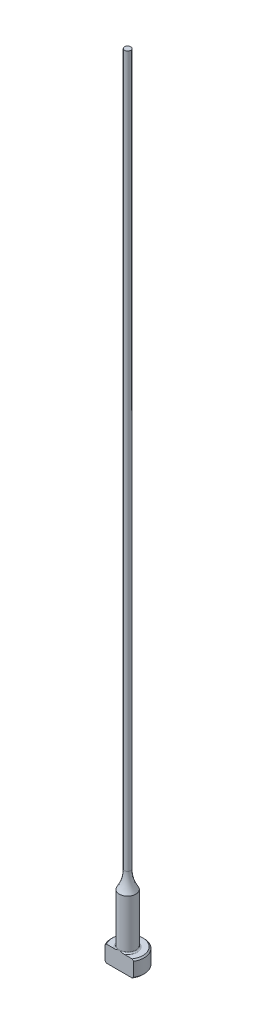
ISO-10303-21;
HEADER;
FILE_DESCRIPTION(('STEP AP214'),'2;1');
FILE_NAME('part.step','',(''),(''),'','','');
FILE_SCHEMA(('AUTOMOTIVE_DESIGN { 1 0 10303 214 1 1 1 1 }'));
ENDSEC;
DATA;
#1=APPLICATION_CONTEXT('core data for automotive mechanical design processes');
#2=APPLICATION_PROTOCOL_DEFINITION('international standard','automotive_design',2000,#1);
#3=PRODUCT_CONTEXT('',#1,'mechanical');
#4=PRODUCT('Part','Part','',(#3));
#5=PRODUCT_RELATED_PRODUCT_CATEGORY('part','',(#4));
#6=PRODUCT_DEFINITION_FORMATION('','',#4);
#7=PRODUCT_DEFINITION_CONTEXT('part definition',#1,'design');
#8=PRODUCT_DEFINITION('design','',#6,#7);
#9=PRODUCT_DEFINITION_SHAPE('','',#8);
#10=(LENGTH_UNIT() NAMED_UNIT(*) SI_UNIT(.MILLI.,.METRE.));
#11=(NAMED_UNIT(*) PLANE_ANGLE_UNIT() SI_UNIT($,.RADIAN.));
#12=(NAMED_UNIT(*) SI_UNIT($,.STERADIAN.) SOLID_ANGLE_UNIT());
#13=UNCERTAINTY_MEASURE_WITH_UNIT(LENGTH_MEASURE(1.E-05),#10,'distance_accuracy_value','');
#14=(GEOMETRIC_REPRESENTATION_CONTEXT(3) GLOBAL_UNCERTAINTY_ASSIGNED_CONTEXT((#13)) GLOBAL_UNIT_ASSIGNED_CONTEXT((#10,
#11,#12)) REPRESENTATION_CONTEXT('',''));
#15=CARTESIAN_POINT('',(0.,0.,0.));
#16=DIRECTION('',(0.,0.,1.));
#17=DIRECTION('',(1.,0.,0.));
#18=AXIS2_PLACEMENT_3D('',#15,#16,#17);
#19=CARTESIAN_POINT('',(-0.594359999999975,152.4,0.));
#20=DIRECTION('',(0.,1.,0.));
#21=DIRECTION('',(0.,0.,1.));
#22=AXIS2_PLACEMENT_3D('',#19,#20,#21);
#23=PLANE('',#22);
#24=CARTESIAN_POINT('',(0.,152.4,0.));
#25=DIRECTION('',(0.,1.,0.));
#26=DIRECTION('',(0.,0.,1.));
#27=AXIS2_PLACEMENT_3D('',#24,#25,#26);
#28=CIRCLE('',#27,0.594359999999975);
#29=CARTESIAN_POINT('',(0.,152.4,0.594359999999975));
#30=VERTEX_POINT('',#29);
#31=EDGE_CURVE('E164',#30,#30,#28,.T.);
#32=ORIENTED_EDGE('',*,*,#31,.T.);
#33=EDGE_LOOP('',(#32));
#34=FACE_BOUND('',#33,.T.);
#35=ADVANCED_FACE('F32',(#34),#23,.T.);
#36=CARTESIAN_POINT('',(0.,259.958771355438,0.));
#37=DIRECTION('',(0.,1.,0.));
#38=DIRECTION('',(0.,0.,1.));
#39=AXIS2_PLACEMENT_3D('',#36,#37,#38);
#40=CYLINDRICAL_SURFACE('',#39,0.594359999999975);
#41=CARTESIAN_POINT('',(0.,16.1097728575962,0.));
#42=DIRECTION('',(0.,1.,0.));
#43=DIRECTION('',(0.,0.,1.));
#44=AXIS2_PLACEMENT_3D('',#41,#42,#43);
#45=CIRCLE('',#44,0.594359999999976);
#46=CARTESIAN_POINT('',(0.,16.1097728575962,0.594359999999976));
#47=VERTEX_POINT('',#46);
#48=EDGE_CURVE('E167',#47,#47,#45,.T.);
#49=ORIENTED_EDGE('',*,*,#48,.T.);
#50=EDGE_LOOP('',(#49));
#51=FACE_BOUND('',#50,.T.);
#52=ORIENTED_EDGE('',*,*,#31,.F.);
#53=EDGE_LOOP('',(#52));
#54=FACE_BOUND('',#53,.T.);
#55=ADVANCED_FACE('F155',(#51,#54),#40,.T.);
#56=CARTESIAN_POINT('',(0.,16.1097728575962,0.));
#57=DIRECTION('',(0.,1.,0.));
#58=DIRECTION('',(0.,0.,1.));
#59=AXIS2_PLACEMENT_3D('',#56,#57,#58);
#60=TOROIDAL_SURFACE('',#59,6.94435999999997,6.35);
#61=CARTESIAN_POINT('',(0.,12.7,0.));
#62=DIRECTION('',(0.,1.,0.));
#63=DIRECTION('',(0.,0.,1.));
#64=AXIS2_PLACEMENT_3D('',#61,#62,#63);
#65=CIRCLE('',#64,1.58749999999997);
#66=CARTESIAN_POINT('',(0.,12.7,1.58749999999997));
#67=VERTEX_POINT('',#66);
#68=EDGE_CURVE('E95',#67,#67,#65,.T.);
#69=ORIENTED_EDGE('',*,*,#68,.T.);
#70=EDGE_LOOP('',(#69));
#71=FACE_BOUND('',#70,.T.);
#72=ORIENTED_EDGE('',*,*,#48,.F.);
#73=EDGE_LOOP('',(#72));
#74=FACE_BOUND('',#73,.T.);
#75=ADVANCED_FACE('F160',(#71,#74),#60,.F.);
#76=CARTESIAN_POINT('',(0.,259.958771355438,0.));
#77=DIRECTION('',(0.,1.,0.));
#78=DIRECTION('',(0.,0.,1.));
#79=AXIS2_PLACEMENT_3D('',#76,#77,#78);
#80=CYLINDRICAL_SURFACE('',#79,1.58749999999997);
#81=CARTESIAN_POINT('',(0.,3.42900000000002,0.));
#82=DIRECTION('',(0.,1.,0.));
#83=DIRECTION('',(0.,0.,1.));
#84=AXIS2_PLACEMENT_3D('',#81,#82,#83);
#85=CIRCLE('',#84,1.58749999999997);
#86=CARTESIAN_POINT('',(0.,3.42900000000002,1.58749999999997));
#87=VERTEX_POINT('',#86);
#88=EDGE_CURVE('E104',#87,#87,#85,.T.);
#89=ORIENTED_EDGE('',*,*,#88,.T.);
#90=EDGE_LOOP('',(#89));
#91=FACE_BOUND('',#90,.T.);
#92=ORIENTED_EDGE('',*,*,#68,.F.);
#93=EDGE_LOOP('',(#92));
#94=FACE_BOUND('',#93,.T.);
#95=ADVANCED_FACE('F187',(#91,#94),#80,.T.);
#96=CARTESIAN_POINT('',(-3.17499999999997,3.175,0.));
#97=DIRECTION('',(0.,1.,0.));
#98=DIRECTION('',(0.,0.,1.));
#99=AXIS2_PLACEMENT_3D('',#96,#97,#98);
#100=PLANE('',#99);
#101=DIRECTION('',(-1.,0.,0.));
#102=VECTOR('',#101,1.);
#103=CARTESIAN_POINT('',(-3.17499999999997,3.175,1.58749999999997));
#104=LINE('',#103,#102);
#105=CARTESIAN_POINT('',(2.45195529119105,3.175,1.58749999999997));
#106=VERTEX_POINT('',#105);
#107=CARTESIAN_POINT('',(0.933255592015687,3.175,1.58749999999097));
#108=VERTEX_POINT('',#107);
#109=EDGE_CURVE('E53',#106,#108,#104,.T.);
#110=ORIENTED_EDGE('',*,*,#109,.F.);
#111=CARTESIAN_POINT('',(0.,3.175,0.));
#112=DIRECTION('',(0.,1.,0.));
#113=DIRECTION('',(0.,0.,1.));
#114=AXIS2_PLACEMENT_3D('',#111,#112,#113);
#115=CIRCLE('',#114,2.92099999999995);
#116=CARTESIAN_POINT('',(-2.45195529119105,3.175,1.58749999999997));
#117=VERTEX_POINT('',#116);
#118=EDGE_CURVE('E166',#106,#117,#115,.T.);
#119=ORIENTED_EDGE('',*,*,#118,.T.);
#120=CARTESIAN_POINT('',(-0.933255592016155,3.17500000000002,1.58749999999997));
#121=VERTEX_POINT('',#120);
#122=EDGE_CURVE('E135',#121,#117,#104,.T.);
#123=ORIENTED_EDGE('',*,*,#122,.F.);
#124=CARTESIAN_POINT('',(0.,3.175,0.));
#125=DIRECTION('',(0.,1.,0.));
#126=DIRECTION('',(0.,0.,1.));
#127=AXIS2_PLACEMENT_3D('',#124,#125,#126);
#128=CIRCLE('',#127,1.84149999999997);
#129=EDGE_CURVE('E108',#121,#108,#128,.F.);
#130=ORIENTED_EDGE('',*,*,#129,.T.);
#131=EDGE_LOOP('',(#110,#119,#123,#130));
#132=FACE_BOUND('',#131,.T.);
#133=ADVANCED_FACE('F184',(#132),#100,.T.);
#134=CARTESIAN_POINT('',(0.,259.958771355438,0.));
#135=DIRECTION('',(0.,1.,0.));
#136=DIRECTION('',(0.,0.,1.));
#137=AXIS2_PLACEMENT_3D('',#134,#135,#136);
#138=CYLINDRICAL_SURFACE('',#137,3.17499999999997);
#139=DIRECTION('',(0.,-1.,0.));
#140=VECTOR('',#139,1.);
#141=CARTESIAN_POINT('',(-2.74963065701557,152.4,1.58749999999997));
#142=LINE('',#141,#140);
#143=CARTESIAN_POINT('',(-2.74963065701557,2.921,1.58749999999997));
#144=VERTEX_POINT('',#143);
#145=CARTESIAN_POINT('',(-2.74963065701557,0.254000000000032,1.58749999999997));
#146=VERTEX_POINT('',#145);
#147=EDGE_CURVE('E90',#144,#146,#142,.T.);
#148=ORIENTED_EDGE('',*,*,#147,.F.);
#149=CARTESIAN_POINT('',(0.,2.92100000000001,0.));
#150=DIRECTION('',(0.,1.,0.));
#151=DIRECTION('',(0.,0.,1.));
#152=AXIS2_PLACEMENT_3D('',#149,#150,#151);
#153=CIRCLE('',#152,3.17499999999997);
#154=CARTESIAN_POINT('',(2.74963065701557,2.921,1.58749999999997));
#155=VERTEX_POINT('',#154);
#156=EDGE_CURVE('E105',#144,#155,#153,.F.);
#157=ORIENTED_EDGE('',*,*,#156,.T.);
#158=DIRECTION('',(0.,-1.,0.));
#159=VECTOR('',#158,1.);
#160=CARTESIAN_POINT('',(2.74963065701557,152.4,1.58749999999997));
#161=LINE('',#160,#159);
#162=CARTESIAN_POINT('',(2.74963065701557,0.254000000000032,1.58749999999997));
#163=VERTEX_POINT('',#162);
#164=EDGE_CURVE('E177',#155,#163,#161,.T.);
#165=ORIENTED_EDGE('',*,*,#164,.T.);
#166=CARTESIAN_POINT('',(0.,0.254000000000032,0.));
#167=DIRECTION('',(0.,-1.,0.));
#168=DIRECTION('',(0.,0.,-1.));
#169=AXIS2_PLACEMENT_3D('',#166,#167,#168);
#170=CIRCLE('',#169,3.17499999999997);
#171=EDGE_CURVE('E111',#163,#146,#170,.F.);
#172=ORIENTED_EDGE('',*,*,#171,.T.);
#173=EDGE_LOOP('',(#148,#157,#165,#172));
#174=FACE_BOUND('',#173,.T.);
#175=ADVANCED_FACE('F175',(#174),#138,.T.);
#176=CARTESIAN_POINT('',(0.,0.,0.));
#177=DIRECTION('',(0.,-1.,0.));
#178=DIRECTION('',(0.,0.,-1.));
#179=AXIS2_PLACEMENT_3D('',#176,#177,#178);
#180=PLANE('',#179);
#181=DIRECTION('',(1.,0.,0.));
#182=VECTOR('',#181,1.);
#183=CARTESIAN_POINT('',(-2.74963065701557,0.,1.58749999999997));
#184=LINE('',#183,#182);
#185=CARTESIAN_POINT('',(-2.45195529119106,0.,1.58749999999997));
#186=VERTEX_POINT('',#185);
#187=CARTESIAN_POINT('',(2.45195529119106,0.,1.58749999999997));
#188=VERTEX_POINT('',#187);
#189=EDGE_CURVE('E87',#186,#188,#184,.T.);
#190=ORIENTED_EDGE('',*,*,#189,.F.);
#191=CARTESIAN_POINT('',(0.,0.,0.));
#192=DIRECTION('',(0.,-1.,0.));
#193=DIRECTION('',(0.,0.,-1.));
#194=AXIS2_PLACEMENT_3D('',#191,#192,#193);
#195=CIRCLE('',#194,2.92099999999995);
#196=EDGE_CURVE('E101',#186,#188,#195,.T.);
#197=ORIENTED_EDGE('',*,*,#196,.T.);
#198=EDGE_LOOP('',(#190,#197));
#199=FACE_BOUND('',#198,.T.);
#200=ADVANCED_FACE('F100',(#199),#180,.T.);
#201=CARTESIAN_POINT('',(0.,3.17499999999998,0.));
#202=DIRECTION('',(0.,-1.,0.));
#203=DIRECTION('',(0.,0.,-1.));
#204=AXIS2_PLACEMENT_3D('',#201,#202,#203);
#205=CONICAL_SURFACE('',#204,2.92099999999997,0.7853981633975);
#206=CARTESIAN_POINT('',(6.0529050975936,-0.161620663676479,1.58749999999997));
#207=CARTESIAN_POINT('',(5.91567682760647,-0.0288893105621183,1.58749999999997));
#208=CARTESIAN_POINT('',(5.77831035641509,0.103699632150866,1.58749999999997));
#209=CARTESIAN_POINT('',(5.5032187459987,0.368508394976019,1.58749999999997));
#210=CARTESIAN_POINT('',(5.36549360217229,0.500728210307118,1.58749999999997));
#211=CARTESIAN_POINT('',(5.08953516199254,0.764778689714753,1.58749999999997));
#212=CARTESIAN_POINT('',(4.95130164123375,0.896609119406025,1.58749999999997));
#213=CARTESIAN_POINT('',(4.67428233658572,1.15968706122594,1.58749999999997));
#214=CARTESIAN_POINT('',(4.53549655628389,1.29093457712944,1.58749999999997));
#215=CARTESIAN_POINT('',(4.2599772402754,1.55007705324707,1.58749999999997));
#216=CARTESIAN_POINT('',(4.12325766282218,1.67798684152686,1.58749999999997));
#217=CARTESIAN_POINT('',(3.84892898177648,1.93284861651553,1.58749999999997));
#218=CARTESIAN_POINT('',(3.71131988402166,2.05980060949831,1.58749999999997));
#219=CARTESIAN_POINT('',(3.43493978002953,2.31237508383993,1.58749999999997));
#220=CARTESIAN_POINT('',(3.29616903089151,2.43799784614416,1.58749999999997));
#221=CARTESIAN_POINT('',(3.01699558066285,2.68741369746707,1.58749999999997));
#222=CARTESIAN_POINT('',(2.87659294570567,2.81120686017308,1.58749999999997));
#223=CARTESIAN_POINT('',(2.6481670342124,3.0087586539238,1.58749999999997));
#224=CARTESIAN_POINT('',(2.56087478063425,3.08336151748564,1.58749999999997));
#225=CARTESIAN_POINT('',(2.38515423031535,3.23123871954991,1.58749999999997));
#226=CARTESIAN_POINT('',(2.29672582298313,3.30451292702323,1.58749999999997));
#227=CARTESIAN_POINT('',(2.1174740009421,3.45004422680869,1.58749999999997));
#228=CARTESIAN_POINT('',(2.02663514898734,3.52228237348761,1.58749999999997));
#229=CARTESIAN_POINT('',(1.8430252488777,3.66423097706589,1.58749999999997));
#230=CARTESIAN_POINT('',(1.75025467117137,3.73394203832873,1.58749999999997));
#231=CARTESIAN_POINT('',(1.56067475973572,3.87080633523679,1.58749999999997));
#232=CARTESIAN_POINT('',(1.4638254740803,3.93790459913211,1.58749999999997));
#233=CARTESIAN_POINT('',(1.266325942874,4.06669147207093,1.58749999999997));
#234=CARTESIAN_POINT('',(1.16567073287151,4.12837264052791,1.58749999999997));
#235=CARTESIAN_POINT('',(1.01165766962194,4.2140225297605,1.58749999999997));
#236=CARTESIAN_POINT('',(0.960142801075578,4.24127929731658,1.58749999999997));
#237=CARTESIAN_POINT('',(0.855780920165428,4.29309798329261,1.58749999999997));
#238=CARTESIAN_POINT('',(0.802933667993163,4.31765941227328,1.58749999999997));
#239=CARTESIAN_POINT('',(0.642461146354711,4.38614656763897,1.58749999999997));
#240=CARTESIAN_POINT('',(0.532518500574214,4.42510149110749,1.58749999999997));
#241=CARTESIAN_POINT('',(0.36768038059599,4.46726244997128,1.58749999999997));
#242=CARTESIAN_POINT('',(0.314802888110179,4.47844427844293,1.58749999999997));
#243=CARTESIAN_POINT('',(0.208209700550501,4.495766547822,1.58749999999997));
#244=CARTESIAN_POINT('',(0.154494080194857,4.50190743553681,1.58749999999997));
#245=CARTESIAN_POINT('',(0.0468792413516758,4.50871296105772,1.58749999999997));
#246=CARTESIAN_POINT('',(-0.00701889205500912,4.50939451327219,1.58749999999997));
#247=CARTESIAN_POINT('',(-0.114606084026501,4.50527679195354,1.58749999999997));
#248=CARTESIAN_POINT('',(-0.16829512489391,4.50047706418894,1.58749999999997));
#249=CARTESIAN_POINT('',(-0.274485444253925,4.48579689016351,1.58749999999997));
#250=CARTESIAN_POINT('',(-0.326992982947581,4.47596081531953,1.58749999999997));
#251=CARTESIAN_POINT('',(-0.430974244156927,4.45181809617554,1.58749999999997));
#252=CARTESIAN_POINT('',(-0.482447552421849,4.43750969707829,1.58749999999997));
#253=CARTESIAN_POINT('',(-0.584460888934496,4.40502489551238,1.58749999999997));
#254=CARTESIAN_POINT('',(-0.63499406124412,4.38682724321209,1.58749999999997));
#255=CARTESIAN_POINT('',(-0.734789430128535,4.34729308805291,1.58749999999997));
#256=CARTESIAN_POINT('',(-0.784051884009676,4.32595722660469,1.58749999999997));
#257=CARTESIAN_POINT('',(-0.930549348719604,4.25791922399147,1.58749999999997));
#258=CARTESIAN_POINT('',(-1.02598802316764,4.20736047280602,1.58749999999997));
#259=CARTESIAN_POINT('',(-1.21304313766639,4.09955451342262,1.58749999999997));
#260=CARTESIAN_POINT('',(-1.30465471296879,4.04229912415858,1.58749999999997));
#261=CARTESIAN_POINT('',(-1.48526211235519,3.9230874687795,1.58749999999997));
#262=CARTESIAN_POINT('',(-1.57424615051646,3.86111349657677,1.58749999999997));
#263=CARTESIAN_POINT('',(-1.74990003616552,3.73408621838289,1.58749999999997));
#264=CARTESIAN_POINT('',(-1.83657099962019,3.66903444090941,1.58749999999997));
#265=CARTESIAN_POINT('',(-2.00931764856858,3.53583371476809,1.58749999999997));
#266=CARTESIAN_POINT('',(-2.09537048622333,3.46765527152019,1.58749999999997));
#267=CARTESIAN_POINT('',(-2.26611736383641,3.32960643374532,1.58749999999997));
#268=CARTESIAN_POINT('',(-2.35081125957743,3.25973586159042,1.58749999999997));
#269=CARTESIAN_POINT('',(-2.60290121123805,3.04858139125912,1.58749999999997));
#270=CARTESIAN_POINT('',(-2.76872537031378,2.9054238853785,1.58749999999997));
#271=CARTESIAN_POINT('',(-3.06970913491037,2.64069522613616,1.58749999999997));
#272=CARTESIAN_POINT('',(-3.20528660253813,2.51959458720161,1.58749999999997));
#273=CARTESIAN_POINT('',(-3.47510321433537,2.275904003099,1.58749999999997));
#274=CARTESIAN_POINT('',(-3.60934232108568,2.15331401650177,1.58749999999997));
#275=CARTESIAN_POINT('',(-3.87695374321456,1.90694239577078,1.58749999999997));
#276=CARTESIAN_POINT('',(-4.01032512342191,1.78315974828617,1.58749999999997));
#277=CARTESIAN_POINT('',(-4.2763088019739,1.53478104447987,1.58749999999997));
#278=CARTESIAN_POINT('',(-4.40892109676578,1.41018498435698,1.58749999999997));
#279=CARTESIAN_POINT('',(-4.79499418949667,1.0457468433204,1.58749999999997));
#280=CARTESIAN_POINT('',(-5.04767313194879,0.805076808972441,1.58749999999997));
#281=CARTESIAN_POINT('',(-5.42550911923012,0.443121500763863,1.58749999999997));
#282=CARTESIAN_POINT('',(-5.55118772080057,0.322378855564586,1.58749999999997));
#283=CARTESIAN_POINT('',(-5.80225207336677,0.0805914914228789,1.58749999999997));
#284=CARTESIAN_POINT('',(-5.92763782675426,-0.0404532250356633,1.58749999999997));
#285=CARTESIAN_POINT('',(-6.0529050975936,-0.161620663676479,1.58749999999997));
#286=B_SPLINE_CURVE_WITH_KNOTS('',3,(#206,#207,#208,#209,#210,#211,#212,#213,#214,#215,#216,
#217,#218,#219,#220,#221,#222,#223,#224,#225,#226,#227,#228,#229,#230,#231,#232,#233,#234,#235,
#236,#237,#238,#239,#240,#241,#242,#243,#244,#245,#246,#247,#248,#249,#250,#251,#252,#253,#254,
#255,#256,#257,#258,#259,#260,#261,#262,#263,#264,#265,#266,#267,#268,#269,#270,#271,#272,#273,
#274,#275,#276,#277,#278,#279,#280,#281,#282,#283,#284,#285),.UNSPECIFIED.,.F.,.F.,(4,2,2,2,2,2,
2,2,2,2,2,2,2,2,2,2,2,2,2,2,2,2,2,2,2,2,2,2,2,2,2,2,2,2,2,2,2,2,2,4),(0.,0.572750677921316,
1.14550874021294,1.71856057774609,2.29160869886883,2.85328006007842,3.41494773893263,
3.97649423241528,4.53801804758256,4.88249307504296,5.22700189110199,5.57515326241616,
5.92322081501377,6.27657800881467,6.63041319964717,6.80518126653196,6.97998101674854,
7.32824262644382,7.49018491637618,7.65211285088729,7.813538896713,7.97497832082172,
8.13501929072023,8.29512313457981,8.4561251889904,8.61709438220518,8.94062993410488,
9.26456495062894,9.58978187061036,9.91483894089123,10.2441741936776,10.5735441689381,
11.2306812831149,11.7760337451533,12.3214014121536,12.8672825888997,13.4131663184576,
14.4600164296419,14.9828595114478,15.505698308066),.UNSPECIFIED.);
#287=EDGE_CURVE('E58',#155,#106,#286,.T.);
#288=ORIENTED_EDGE('',*,*,#287,.F.);
#289=ORIENTED_EDGE('',*,*,#156,.F.);
#290=EDGE_CURVE('E128',#117,#144,#286,.T.);
#291=ORIENTED_EDGE('',*,*,#290,.F.);
#292=ORIENTED_EDGE('',*,*,#118,.F.);
#293=EDGE_LOOP('',(#288,#289,#291,#292));
#294=FACE_BOUND('',#293,.T.);
#295=ADVANCED_FACE('F142',(#294),#205,.T.);
#296=CARTESIAN_POINT('',(0.,0.254000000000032,0.));
#297=DIRECTION('',(0.,1.,0.));
#298=DIRECTION('',(0.,0.,1.));
#299=AXIS2_PLACEMENT_3D('',#296,#297,#298);
#300=CONICAL_SURFACE('',#299,3.17499999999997,0.785398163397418);
#301=CARTESIAN_POINT('',(-6.0529050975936,3.33662066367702,1.58749999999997));
#302=CARTESIAN_POINT('',(-5.91567682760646,3.20388931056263,1.58749999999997));
#303=CARTESIAN_POINT('',(-5.77831035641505,3.0713003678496,1.58749999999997));
#304=CARTESIAN_POINT('',(-5.50321874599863,2.80649160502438,1.58749999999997));
#305=CARTESIAN_POINT('',(-5.36549360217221,2.67427178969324,1.58749999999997));
#306=CARTESIAN_POINT('',(-5.08953516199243,2.41022131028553,1.58749999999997));
#307=CARTESIAN_POINT('',(-4.95130164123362,2.27839088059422,1.58749999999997));
#308=CARTESIAN_POINT('',(-4.67428233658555,2.01531293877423,1.58749999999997));
#309=CARTESIAN_POINT('',(-4.5354965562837,1.8840654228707,1.58749999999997));
#310=CARTESIAN_POINT('',(-4.25997724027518,1.62492294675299,1.58749999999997));
#311=CARTESIAN_POINT('',(-4.12325766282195,1.49701315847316,1.58749999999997));
#312=CARTESIAN_POINT('',(-3.84892898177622,1.24215138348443,1.58749999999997));
#313=CARTESIAN_POINT('',(-3.71131988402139,1.11519939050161,1.58749999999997));
#314=CARTESIAN_POINT('',(-3.43493978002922,0.862624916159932,1.58749999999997));
#315=CARTESIAN_POINT('',(-3.29616903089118,0.737002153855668,1.58749999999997));
#316=CARTESIAN_POINT('',(-3.01699558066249,0.487586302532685,1.58749999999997));
#317=CARTESIAN_POINT('',(-2.8765929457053,0.363793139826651,1.58749999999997));
#318=CARTESIAN_POINT('',(-2.64816703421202,0.1662413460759,1.58749999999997));
#319=CARTESIAN_POINT('',(-2.56087478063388,0.0916384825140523,1.58749999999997));
#320=CARTESIAN_POINT('',(-2.385154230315,-0.0562387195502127,1.58749999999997));
#321=CARTESIAN_POINT('',(-2.29672582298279,-0.129512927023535,1.58749999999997));
#322=CARTESIAN_POINT('',(-2.11747400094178,-0.275044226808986,1.58749999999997));
#323=CARTESIAN_POINT('',(-2.02663514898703,-0.34728237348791,1.58749999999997));
#324=CARTESIAN_POINT('',(-1.84302524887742,-0.489230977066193,1.58749999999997));
#325=CARTESIAN_POINT('',(-1.75025467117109,-0.558942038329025,1.58749999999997));
#326=CARTESIAN_POINT('',(-1.56067475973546,-0.695806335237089,1.58749999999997));
#327=CARTESIAN_POINT('',(-1.46382547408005,-0.762904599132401,1.58749999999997));
#328=CARTESIAN_POINT('',(-1.26632594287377,-0.89169147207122,1.58749999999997));
#329=CARTESIAN_POINT('',(-1.16567073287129,-0.953372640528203,1.58749999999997));
#330=CARTESIAN_POINT('',(-1.01165766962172,-1.03902252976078,1.58749999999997));
#331=CARTESIAN_POINT('',(-0.960142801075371,-1.06627929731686,1.58749999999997));
#332=CARTESIAN_POINT('',(-0.855780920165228,-1.11809798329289,1.58749999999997));
#333=CARTESIAN_POINT('',(-0.802933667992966,-1.14265941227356,1.58749999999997));
#334=CARTESIAN_POINT('',(-0.642461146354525,-1.21114656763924,1.58749999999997));
#335=CARTESIAN_POINT('',(-0.532518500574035,-1.25010149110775,1.58749999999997));
#336=CARTESIAN_POINT('',(-0.367680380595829,-1.29226244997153,1.58749999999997));
#337=CARTESIAN_POINT('',(-0.314802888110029,-1.30344427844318,1.58749999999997));
#338=CARTESIAN_POINT('',(-0.208209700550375,-1.32076654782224,1.58749999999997));
#339=CARTESIAN_POINT('',(-0.154494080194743,-1.32690743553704,1.58749999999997));
#340=CARTESIAN_POINT('',(-0.0468792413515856,-1.33371296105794,1.58749999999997));
#341=CARTESIAN_POINT('',(0.00701889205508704,-1.33439451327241,1.58749999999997));
#342=CARTESIAN_POINT('',(0.114606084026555,-1.33027679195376,1.58749999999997));
#343=CARTESIAN_POINT('',(0.168295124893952,-1.32547706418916,1.58749999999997));
#344=CARTESIAN_POINT('',(0.274485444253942,-1.31079689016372,1.58749999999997));
#345=CARTESIAN_POINT('',(0.326992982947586,-1.30096081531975,1.58749999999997));
#346=CARTESIAN_POINT('',(0.430974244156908,-1.27681809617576,1.58749999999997));
#347=CARTESIAN_POINT('',(0.482447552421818,-1.26250969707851,1.58749999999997));
#348=CARTESIAN_POINT('',(0.58446088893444,-1.2300248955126,1.58749999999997));
#349=CARTESIAN_POINT('',(0.634994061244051,-1.21182724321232,1.58749999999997));
#350=CARTESIAN_POINT('',(0.734789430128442,-1.17229308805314,1.58749999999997));
#351=CARTESIAN_POINT('',(0.784051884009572,-1.15095722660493,1.58749999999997));
#352=CARTESIAN_POINT('',(0.930549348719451,-1.08291922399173,1.58749999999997));
#353=CARTESIAN_POINT('',(1.02598802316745,-1.0323604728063,1.58749999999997));
#354=CARTESIAN_POINT('',(1.21304313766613,-0.924554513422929,1.58749999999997));
#355=CARTESIAN_POINT('',(1.30465471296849,-0.867299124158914,1.58749999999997));
#356=CARTESIAN_POINT('',(1.48526211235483,-0.748087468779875,1.58749999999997));
#357=CARTESIAN_POINT('',(1.57424615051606,-0.686113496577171,1.58749999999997));
#358=CARTESIAN_POINT('',(1.74990003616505,-0.559086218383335,1.58749999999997));
#359=CARTESIAN_POINT('',(1.83657099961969,-0.494034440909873,1.58749999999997));
#360=CARTESIAN_POINT('',(2.00931764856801,-0.360833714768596,1.58749999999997));
#361=CARTESIAN_POINT('',(2.09537048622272,-0.292655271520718,1.58749999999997));
#362=CARTESIAN_POINT('',(2.26611736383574,-0.1546064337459,1.58749999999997));
#363=CARTESIAN_POINT('',(2.35081125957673,-0.0847358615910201,1.58749999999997));
#364=CARTESIAN_POINT('',(2.60290121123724,0.126418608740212,1.58749999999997));
#365=CARTESIAN_POINT('',(2.76872537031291,0.269576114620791,1.58749999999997));
#366=CARTESIAN_POINT('',(3.06970913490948,0.534304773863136,1.58749999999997));
#367=CARTESIAN_POINT('',(3.20528660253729,0.65540541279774,1.58749999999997));
#368=CARTESIAN_POINT('',(3.47510321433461,0.899095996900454,1.58749999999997));
#369=CARTESIAN_POINT('',(3.60934232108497,1.02168598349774,1.58749999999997));
#370=CARTESIAN_POINT('',(3.87695374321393,1.26805760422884,1.58749999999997));
#371=CARTESIAN_POINT('',(4.01032512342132,1.39184025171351,1.58749999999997));
#372=CARTESIAN_POINT('',(4.2763088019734,1.64021895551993,1.58749999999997));
#373=CARTESIAN_POINT('',(4.40892109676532,1.76481501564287,1.58749999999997));
#374=CARTESIAN_POINT('',(4.79499418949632,2.12925315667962,1.58749999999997));
#375=CARTESIAN_POINT('',(5.04767313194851,2.36992319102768,1.58749999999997));
#376=CARTESIAN_POINT('',(5.42550911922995,2.73187849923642,1.58749999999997));
#377=CARTESIAN_POINT('',(5.55118772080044,2.85262114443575,1.58749999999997));
#378=CARTESIAN_POINT('',(5.8022520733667,3.09440850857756,1.58749999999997));
#379=CARTESIAN_POINT('',(5.92763782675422,3.21545322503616,1.58749999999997));
#380=CARTESIAN_POINT('',(6.0529050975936,3.33662066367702,1.58749999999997));
#381=B_SPLINE_CURVE_WITH_KNOTS('',3,(#301,#302,#303,#304,#305,#306,#307,#308,#309,#310,#311,
#312,#313,#314,#315,#316,#317,#318,#319,#320,#321,#322,#323,#324,#325,#326,#327,#328,#329,#330,
#331,#332,#333,#334,#335,#336,#337,#338,#339,#340,#341,#342,#343,#344,#345,#346,#347,#348,#349,
#350,#351,#352,#353,#354,#355,#356,#357,#358,#359,#360,#361,#362,#363,#364,#365,#366,#367,#368,
#369,#370,#371,#372,#373,#374,#375,#376,#377,#378,#379,#380),.UNSPECIFIED.,.F.,.F.,(4,2,2,2,2,2,
2,2,2,2,2,2,2,2,2,2,2,2,2,2,2,2,2,2,2,2,2,2,2,2,2,2,2,2,2,2,2,2,2,4),(0.,0.57275067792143,
1.14550874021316,1.71856057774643,2.29160869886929,2.85328006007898,3.41494773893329,
3.97649423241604,4.53801804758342,4.8824930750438,5.22700189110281,5.57515326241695,
5.92322081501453,6.27657800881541,6.63041319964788,6.80518126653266,6.97998101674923,
7.32824262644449,7.49018491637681,7.65211285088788,7.81353889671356,7.97497832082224,
8.13501929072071,8.29512313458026,8.45612518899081,8.61709438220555,8.94062993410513,
9.26456495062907,9.58978187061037,9.91483894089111,10.2441741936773,10.5735441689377,
11.2306812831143,11.776033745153,12.3214014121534,12.8672825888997,13.4131663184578,
14.4600164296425,14.9828595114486,15.505698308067),.UNSPECIFIED.);
#382=EDGE_CURVE('E84',#146,#186,#381,.T.);
#383=ORIENTED_EDGE('',*,*,#382,.F.);
#384=ORIENTED_EDGE('',*,*,#171,.F.);
#385=EDGE_CURVE('E96',#188,#163,#381,.T.);
#386=ORIENTED_EDGE('',*,*,#385,.F.);
#387=ORIENTED_EDGE('',*,*,#196,.F.);
#388=EDGE_LOOP('',(#383,#384,#386,#387));
#389=FACE_BOUND('',#388,.T.);
#390=ADVANCED_FACE('F103',(#389),#300,.T.);
#391=CARTESIAN_POINT('',(0.,3.42900000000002,0.));
#392=DIRECTION('',(0.,1.,0.));
#393=DIRECTION('',(0.,0.,1.));
#394=AXIS2_PLACEMENT_3D('',#391,#392,#393);
#395=TOROIDAL_SURFACE('',#394,1.84149999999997,0.254);
#396=ORIENTED_EDGE('',*,*,#129,.F.);
#397=CARTESIAN_POINT('',(0.,3.42900000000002,1.58749999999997));
#398=CARTESIAN_POINT('',(-1.92205022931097E-10,3.42900057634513,1.58749999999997));
#399=CARTESIAN_POINT('',(-1.22611612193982E-07,3.42900115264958,1.58749999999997));
#400=CARTESIAN_POINT('',(-5.09676358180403E-07,3.42900226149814,1.58749999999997));
#401=CARTESIAN_POINT('',(-7.78176318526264E-07,3.42900279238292,1.58749999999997));
#402=CARTESIAN_POINT('',(-1.42307271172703E-06,3.42900385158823,1.58749999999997));
#403=CARTESIAN_POINT('',(-1.80713865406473E-06,3.4290043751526,1.58749999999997));
#404=CARTESIAN_POINT('',(-2.63494844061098E-06,3.42900536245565,1.58749999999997));
#405=CARTESIAN_POINT('',(-3.07814754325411E-06,3.42900582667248,1.58749999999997));
#406=CARTESIAN_POINT('',(-4.6689735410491E-06,3.4290073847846,1.58749999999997));
#407=CARTESIAN_POINT('',(-5.89404904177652E-06,3.42900840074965,1.58749999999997));
#408=CARTESIAN_POINT('',(-8.42427506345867E-06,3.42901020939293,1.58749999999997));
#409=CARTESIAN_POINT('',(-9.72480569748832E-06,3.42901100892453,1.58749999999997));
#410=CARTESIAN_POINT('',(-1.48060601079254E-05,3.42901401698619,1.58749999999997));
#411=CARTESIAN_POINT('',(-1.86838280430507E-05,3.42901606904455,1.58749999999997));
#412=CARTESIAN_POINT('',(-2.6326111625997E-05,3.42901942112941,1.58749999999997));
#413=CARTESIAN_POINT('',(-3.00687416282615E-05,3.42902077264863,1.58749999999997));
#414=CARTESIAN_POINT('',(-4.6027629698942E-05,3.4290265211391,1.58749999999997));
#415=CARTESIAN_POINT('',(-5.82470196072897E-05,3.42903088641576,1.58749999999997));
#416=CARTESIAN_POINT('',(-8.11070094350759E-05,3.42903788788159,1.58749999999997));
#417=CARTESIAN_POINT('',(-9.16953111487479E-05,3.42904068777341,1.58749999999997));
#418=CARTESIAN_POINT('',(-0.000168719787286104,3.42906287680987,1.58749999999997));
#419=CARTESIAN_POINT('',(-0.000232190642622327,3.42909118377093,1.58749999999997));
#420=CARTESIAN_POINT('',(-0.000479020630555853,3.42919723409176,1.58749999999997));
#421=CARTESIAN_POINT('',(-0.000664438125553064,3.42926834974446,1.58749999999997));
#422=CARTESIAN_POINT('',(-0.00138448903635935,3.4295486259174,1.58749999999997));
#423=CARTESIAN_POINT('',(-0.00191701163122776,3.42976473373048,1.58749999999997));
#424=CARTESIAN_POINT('',(-0.00409774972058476,3.43064550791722,1.58749999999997));
#425=CARTESIAN_POINT('',(-0.00574830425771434,3.43130231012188,1.58749999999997));
#426=CARTESIAN_POINT('',(-0.0289985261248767,3.44055947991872,1.58749999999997));
#427=CARTESIAN_POINT('',(-0.0505816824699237,3.44921674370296,1.58749999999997));
#428=CARTESIAN_POINT('',(-0.0929947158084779,3.46610702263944,1.58749999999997));
#429=CARTESIAN_POINT('',(-0.113823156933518,3.47434394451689,1.58749999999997));
#430=CARTESIAN_POINT('',(-0.157956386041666,3.49164606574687,1.58749999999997));
#431=CARTESIAN_POINT('',(-0.181267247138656,3.50069608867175,1.58749999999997));
#432=CARTESIAN_POINT('',(-0.228222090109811,3.51863224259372,1.58749999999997));
#433=CARTESIAN_POINT('',(-0.251867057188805,3.52751579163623,1.58749999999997));
#434=CARTESIAN_POINT('',(-0.310512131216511,3.54905503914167,1.58749999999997));
#435=CARTESIAN_POINT('',(-0.345588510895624,3.56150550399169,1.58749999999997));
#436=CARTESIAN_POINT('',(-0.415278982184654,3.58503024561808,1.58749999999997));
#437=CARTESIAN_POINT('',(-0.449884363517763,3.59613012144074,1.58749999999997));
#438=CARTESIAN_POINT('',(-0.52447121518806,3.61841679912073,1.58749999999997));
#439=CARTESIAN_POINT('',(-0.56451722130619,3.62939137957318,1.58749999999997));
#440=CARTESIAN_POINT('',(-0.645529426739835,3.6489746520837,1.58749999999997));
#441=CARTESIAN_POINT('',(-0.686500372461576,3.65756417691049,1.58749999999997));
#442=CARTESIAN_POINT('',(-0.771546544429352,3.67188287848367,1.58749999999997));
#443=CARTESIAN_POINT('',(-0.815658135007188,3.67740449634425,1.58749999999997));
#444=CARTESIAN_POINT('',(-0.904117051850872,3.68344603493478,1.58749999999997));
#445=CARTESIAN_POINT('',(-0.948462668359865,3.68398638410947,1.58749999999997));
#446=CARTESIAN_POINT('',(-1.02531896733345,3.67901051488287,1.58749999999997));
#447=CARTESIAN_POINT('',(-1.05792141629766,3.67502604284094,1.58749999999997));
#448=CARTESIAN_POINT('',(-1.12184393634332,3.6623083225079,1.58749999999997));
#449=CARTESIAN_POINT('',(-1.15317534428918,3.65363950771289,1.58749999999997));
#450=CARTESIAN_POINT('',(-1.19946468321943,3.63563847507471,1.58749999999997));
#451=CARTESIAN_POINT('',(-1.2152678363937,3.62848492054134,1.58749999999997));
#452=CARTESIAN_POINT('',(-1.24583726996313,3.61212937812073,1.58749999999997));
#453=CARTESIAN_POINT('',(-1.26060215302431,3.60292469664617,1.58749999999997));
#454=CARTESIAN_POINT('',(-1.28575815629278,3.58421518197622,1.58749999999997));
#455=CARTESIAN_POINT('',(-1.29644383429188,3.57510998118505,1.58749999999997));
#456=CARTESIAN_POINT('',(-1.31623154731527,3.55531539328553,1.58749999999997));
#457=CARTESIAN_POINT('',(-1.32533681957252,3.54462932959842,1.58749999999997));
#458=CARTESIAN_POINT('',(-1.33941140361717,3.52450022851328,1.58749999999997));
#459=CARTESIAN_POINT('',(-1.34484814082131,3.51538553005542,1.58749999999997));
#460=CARTESIAN_POINT('',(-1.35416329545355,3.49638544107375,1.58749999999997));
#461=CARTESIAN_POINT('',(-1.35804267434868,3.48650053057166,1.58749999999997));
#462=CARTESIAN_POINT('',(-1.36398436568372,3.46611321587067,1.58749999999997));
#463=CARTESIAN_POINT('',(-1.36603350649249,3.45560690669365,1.58749999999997));
#464=CARTESIAN_POINT('',(-1.3680840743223,3.43439627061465,1.58749999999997));
#465=CARTESIAN_POINT('',(-1.36808648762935,3.42369204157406,1.58749999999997));
#466=CARTESIAN_POINT('',(-1.36616208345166,3.40366716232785,1.58749999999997));
#467=CARTESIAN_POINT('',(-1.36444960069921,3.39432493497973,1.58749999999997));
#468=CARTESIAN_POINT('',(-1.35953338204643,3.37604480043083,1.58749999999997));
#469=CARTESIAN_POINT('',(-1.3563294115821,3.36710695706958,1.58749999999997));
#470=CARTESIAN_POINT('',(-1.34848006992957,3.34949697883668,1.58749999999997));
#471=CARTESIAN_POINT('',(-1.34378578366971,3.34084688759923,1.58749999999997));
#472=CARTESIAN_POINT('',(-1.33324445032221,3.32428742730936,1.58749999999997));
#473=CARTESIAN_POINT('',(-1.32739692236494,3.3163783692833,1.58749999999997));
#474=CARTESIAN_POINT('',(-1.3110730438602,3.29692878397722,1.58749999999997));
#475=CARTESIAN_POINT('',(-1.29989286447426,3.28597778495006,1.58749999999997));
#476=CARTESIAN_POINT('',(-1.27593566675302,3.26597490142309,1.58749999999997));
#477=CARTESIAN_POINT('',(-1.26315370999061,3.25692913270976,1.58749999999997));
#478=CARTESIAN_POINT('',(-1.2293073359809,3.23613976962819,1.58749999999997));
#479=CARTESIAN_POINT('',(-1.20751096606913,3.225594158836,1.58749999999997));
#480=CARTESIAN_POINT('',(-1.16266144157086,3.20795356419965,1.58749999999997));
#481=CARTESIAN_POINT('',(-1.13960937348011,3.20085564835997,1.58749999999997));
#482=CARTESIAN_POINT('',(-1.07603916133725,3.18534571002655,1.58749999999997));
#483=CARTESIAN_POINT('',(-1.03486686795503,3.17965078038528,1.58749999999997));
#484=CARTESIAN_POINT('',(-0.951558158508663,3.1741711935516,1.58749999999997));
#485=CARTESIAN_POINT('',(-0.909417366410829,3.17449023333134,1.58749999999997));
#486=CARTESIAN_POINT('',(-0.811383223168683,3.18054602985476,1.58749999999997));
#487=CARTESIAN_POINT('',(-0.755610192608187,3.18806126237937,1.58749999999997));
#488=CARTESIAN_POINT('',(-0.64493786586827,3.20866626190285,1.58749999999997));
#489=CARTESIAN_POINT('',(-0.59004364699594,3.22178102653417,1.58749999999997));
#490=CARTESIAN_POINT('',(-0.485757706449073,3.25059077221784,1.58749999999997));
#491=CARTESIAN_POINT('',(-0.436281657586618,3.26598903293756,1.58749999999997));
#492=CARTESIAN_POINT('',(-0.338551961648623,3.29877502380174,1.58749999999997));
#493=CARTESIAN_POINT('',(-0.290291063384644,3.31614156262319,1.58749999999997));
#494=CARTESIAN_POINT('',(-0.22555793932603,3.34039762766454,1.58749999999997));
#495=CARTESIAN_POINT('',(-0.208874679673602,3.34673586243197,1.58749999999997));
#496=CARTESIAN_POINT('',(-0.175123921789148,3.35969957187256,1.58749999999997));
#497=CARTESIAN_POINT('',(-0.158057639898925,3.36632823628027,1.58749999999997));
#498=CARTESIAN_POINT('',(-0.117638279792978,3.38214476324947,1.58749999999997));
#499=CARTESIAN_POINT('',(-0.0943002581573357,3.39137029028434,1.58749999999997));
#500=CARTESIAN_POINT('',(-0.0497824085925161,3.40910304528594,1.58749999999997));
#501=CARTESIAN_POINT('',(-0.0285986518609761,3.41759960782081,1.58749999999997));
#502=CARTESIAN_POINT('',(-0.00575168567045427,3.42669635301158,1.58749999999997));
#503=CARTESIAN_POINT('',(-0.00410451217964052,3.42735181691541,1.58749999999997));
#504=CARTESIAN_POINT('',(-0.00192459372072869,3.42823223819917,1.58749999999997));
#505=CARTESIAN_POINT('',(-0.00138952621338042,3.42844937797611,1.58749999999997));
#506=CARTESIAN_POINT('',(-0.000666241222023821,3.42873091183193,1.58749999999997));
#507=CARTESIAN_POINT('',(-0.000480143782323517,3.42880228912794,1.58749999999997));
#508=CARTESIAN_POINT('',(-0.000232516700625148,3.42890868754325,1.58749999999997));
#509=CARTESIAN_POINT('',(-0.00016892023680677,3.42893705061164,1.58749999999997));
#510=CARTESIAN_POINT('',(-9.17527158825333E-05,3.42895927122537,1.58749999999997));
#511=CARTESIAN_POINT('',(-8.11550290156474E-05,3.42896207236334,1.58749999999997));
#512=CARTESIAN_POINT('',(-5.82743946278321E-05,3.42896908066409,1.58749999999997));
#513=CARTESIAN_POINT('',(-4.60439999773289E-05,3.42897345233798,1.58749999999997));
#514=CARTESIAN_POINT('',(-3.00727680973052E-05,3.42897920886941,1.58749999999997));
#515=CARTESIAN_POINT('',(-2.63286806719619E-05,3.42898056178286,1.58749999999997));
#516=CARTESIAN_POINT('',(-1.86836528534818E-05,3.42898391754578,1.58749999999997));
#517=CARTESIAN_POINT('',(-1.48046516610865E-05,3.42898597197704,1.58749999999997));
#518=CARTESIAN_POINT('',(-9.72223938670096E-06,3.42898898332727,1.58749999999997));
#519=CARTESIAN_POINT('',(-8.4215964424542E-06,3.42898978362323,1.58749999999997));
#520=CARTESIAN_POINT('',(-5.89129725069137E-06,3.42899159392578,1.58749999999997));
#521=CARTESIAN_POINT('',(-4.66626863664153E-06,3.42899261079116,1.58749999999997));
#522=CARTESIAN_POINT('',(-3.07568801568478E-06,3.42899417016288,1.58749999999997));
#523=CARTESIAN_POINT('',(-2.63259563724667E-06,3.4289946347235,1.58749999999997));
#524=CARTESIAN_POINT('',(-1.80506083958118E-06,3.42899562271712,1.58749999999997));
#525=CARTESIAN_POINT('',(-1.42116386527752E-06,3.4289961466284,1.58749999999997));
#526=CARTESIAN_POINT('',(-7.76675633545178E-07,3.42899720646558,1.58749999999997));
#527=CARTESIAN_POINT('',(-5.0840648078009E-07,3.42899773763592,1.58749999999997));
#528=CARTESIAN_POINT('',(-1.21901884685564E-07,3.42899884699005,1.58749999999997));
#529=CARTESIAN_POINT('',(1.92251552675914E-10,3.42899942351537,1.58749999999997));
#530=CARTESIAN_POINT('',(0.,3.42900000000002,1.58749999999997));
#531=B_SPLINE_CURVE_WITH_KNOTS('',3,(#397,#398,#399,#400,#401,#402,#403,#404,#405,#406,#407,
#408,#409,#410,#411,#412,#413,#414,#415,#416,#417,#418,#419,#420,#421,#422,#423,#424,#425,#426,
#427,#428,#429,#430,#431,#432,#433,#434,#435,#436,#437,#438,#439,#440,#441,#442,#443,#444,#445,
#446,#447,#448,#449,#450,#451,#452,#453,#454,#455,#456,#457,#458,#459,#460,#461,#462,#463,#464,
#465,#466,#467,#468,#469,#470,#471,#472,#473,#474,#475,#476,#477,#478,#479,#480,#481,#482,#483,
#484,#485,#486,#487,#488,#489,#490,#491,#492,#493,#494,#495,#496,#497,#498,#499,#500,#501,#502,
#503,#504,#505,#506,#507,#508,#509,#510,#511,#512,#513,#514,#515,#516,#517,#518,#519,#520,#521,
#522,#523,#524,#525,#526,#527,#528,#529,#530),.UNSPECIFIED.,.T.,.F.,(4,2,2,2,2,2,2,2,2,2,2,2,2,
2,2,2,2,2,2,2,2,2,2,2,2,2,2,2,2,2,2,2,2,2,2,2,2,2,2,2,2,2,2,2,2,2,2,2,2,2,2,2,2,2,2,2,2,2,2,2,2,
2,2,2,2,2,4),(0.,1.72815463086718E-06,3.50429263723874E-06,5.44431015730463E-06,
7.36755264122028E-06,1.2119089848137E-05,1.66953777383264E-05,2.98160402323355E-05,
4.17409566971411E-05,8.06604755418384E-05,0.000113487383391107,0.000321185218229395,
0.000917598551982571,0.00264089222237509,0.00797105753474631,0.0777276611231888,
0.144923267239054,0.21993959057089,0.295714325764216,0.407362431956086,0.51636778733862,
0.640878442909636,0.766362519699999,0.899536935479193,1.03216495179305,1.13045740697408,
1.22743103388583,1.27935899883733,1.33135556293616,1.37333248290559,1.41522237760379,
1.44693946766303,1.47863694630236,1.51056074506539,1.54246916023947,1.57083210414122,
1.59919951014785,1.62861579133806,1.65804436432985,1.70472658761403,1.75155645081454,
1.82378709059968,1.89595619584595,2.01995471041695,2.14609321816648,2.31447224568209,
2.4836109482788,2.63898919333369,2.79283011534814,2.84637031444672,2.90129461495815,
2.97658236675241,3.04504771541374,3.05036697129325,3.052098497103,3.05269709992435,
3.05290520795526,3.05293806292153,3.05297701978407,3.05298895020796,3.05300207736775,
3.05300665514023,3.05301140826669,3.05301333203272,3.05301527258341,3.05301704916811,
3.0530187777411),.UNSPECIFIED.);
#532=EDGE_CURVE('E11',#121,#87,#531,.T.);
#533=ORIENTED_EDGE('',*,*,#532,.T.);
#534=ORIENTED_EDGE('',*,*,#88,.F.);
#535=CARTESIAN_POINT('',(0.,3.42900000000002,1.58749999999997));
#536=CARTESIAN_POINT('',(1.92205049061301E-10,3.4289994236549,1.58749999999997));
#537=CARTESIAN_POINT('',(1.22611612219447E-07,3.42899884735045,1.58749999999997));
#538=CARTESIAN_POINT('',(5.09676358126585E-07,3.42899773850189,1.58749999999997));
#539=CARTESIAN_POINT('',(7.78176318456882E-07,3.42899720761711,1.58749999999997));
#540=CARTESIAN_POINT('',(1.42307271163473E-06,3.4289961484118,1.58749999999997));
#541=CARTESIAN_POINT('',(1.80713865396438E-06,3.42899562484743,1.58749999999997));
#542=CARTESIAN_POINT('',(2.63494844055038E-06,3.42899463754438,1.58749999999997));
#543=CARTESIAN_POINT('',(3.07814754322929E-06,3.42899417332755,1.58749999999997));
#544=CARTESIAN_POINT('',(4.66897354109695E-06,3.42899261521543,1.58749999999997));
#545=CARTESIAN_POINT('',(5.89404904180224E-06,3.42899159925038,1.58749999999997));
#546=CARTESIAN_POINT('',(8.42427506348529E-06,3.4289897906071,1.58749999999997));
#547=CARTESIAN_POINT('',(9.72480569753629E-06,3.4289889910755,1.58749999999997));
#548=CARTESIAN_POINT('',(1.48060601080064E-05,3.42898598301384,1.58749999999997));
#549=CARTESIAN_POINT('',(1.86838280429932E-05,3.42898393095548,1.58749999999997));
#550=CARTESIAN_POINT('',(2.63261116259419E-05,3.42898057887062,1.58749999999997));
#551=CARTESIAN_POINT('',(3.00687416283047E-05,3.4289792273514,1.58749999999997));
#552=CARTESIAN_POINT('',(4.60276296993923E-05,3.42897347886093,1.58749999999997));
#553=CARTESIAN_POINT('',(5.8247019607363E-05,3.42896911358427,1.58749999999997));
#554=CARTESIAN_POINT('',(8.11070094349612E-05,3.42896211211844,1.58749999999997));
#555=CARTESIAN_POINT('',(9.1695311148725E-05,3.42895931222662,1.58749999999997));
#556=CARTESIAN_POINT('',(0.000168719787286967,3.42893712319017,1.58749999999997));
#557=CARTESIAN_POINT('',(0.000232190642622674,3.4289088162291,1.58749999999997));
#558=CARTESIAN_POINT('',(0.000479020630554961,3.42880276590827,1.58749999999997));
#559=CARTESIAN_POINT('',(0.000664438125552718,3.42873165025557,1.58749999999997));
#560=CARTESIAN_POINT('',(0.00138448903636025,3.42845137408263,1.58749999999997));
#561=CARTESIAN_POINT('',(0.00191701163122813,3.42823526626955,1.58749999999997));
#562=CARTESIAN_POINT('',(0.00409774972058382,3.42735449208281,1.58749999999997));
#563=CARTESIAN_POINT('',(0.0057483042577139,3.42669768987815,1.58749999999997));
#564=CARTESIAN_POINT('',(0.0289985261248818,3.41744052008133,1.58749999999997));
#565=CARTESIAN_POINT('',(0.0505816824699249,3.40878325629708,1.58749999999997));
#566=CARTESIAN_POINT('',(0.0929947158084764,3.39189297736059,1.58749999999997));
#567=CARTESIAN_POINT('',(0.113823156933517,3.38365605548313,1.58749999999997));
#568=CARTESIAN_POINT('',(0.157956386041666,3.36635393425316,1.58749999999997));
#569=CARTESIAN_POINT('',(0.181267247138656,3.35730391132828,1.58749999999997));
#570=CARTESIAN_POINT('',(0.228222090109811,3.33936775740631,1.58749999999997));
#571=CARTESIAN_POINT('',(0.251867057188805,3.3304842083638,1.58749999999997));
#572=CARTESIAN_POINT('',(0.310512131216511,3.30894496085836,1.58749999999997));
#573=CARTESIAN_POINT('',(0.345588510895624,3.29649449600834,1.58749999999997));
#574=CARTESIAN_POINT('',(0.415278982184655,3.27296975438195,1.58749999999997));
#575=CARTESIAN_POINT('',(0.449884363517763,3.26186987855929,1.58749999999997));
#576=CARTESIAN_POINT('',(0.52447121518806,3.23958320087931,1.58749999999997));
#577=CARTESIAN_POINT('',(0.564517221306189,3.22860862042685,1.58749999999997));
#578=CARTESIAN_POINT('',(0.645529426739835,3.20902534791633,1.58749999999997));
#579=CARTESIAN_POINT('',(0.686500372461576,3.20043582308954,1.58749999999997));
#580=CARTESIAN_POINT('',(0.771546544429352,3.18611712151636,1.58749999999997));
#581=CARTESIAN_POINT('',(0.815658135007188,3.18059550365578,1.58749999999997));
#582=CARTESIAN_POINT('',(0.904117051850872,3.17455396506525,1.58749999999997));
#583=CARTESIAN_POINT('',(0.948462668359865,3.17401361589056,1.58749999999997));
#584=CARTESIAN_POINT('',(1.02531896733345,3.17898948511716,1.58749999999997));
#585=CARTESIAN_POINT('',(1.05792141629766,3.1829739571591,1.58749999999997));
#586=CARTESIAN_POINT('',(1.12184393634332,3.19569167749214,1.58749999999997));
#587=CARTESIAN_POINT('',(1.15317534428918,3.20436049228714,1.58749999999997));
#588=CARTESIAN_POINT('',(1.19946468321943,3.22236152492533,1.58749999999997));
#589=CARTESIAN_POINT('',(1.2152678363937,3.22951507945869,1.58749999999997));
#590=CARTESIAN_POINT('',(1.24583726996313,3.2458706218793,1.58749999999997));
#591=CARTESIAN_POINT('',(1.26060215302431,3.25507530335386,1.58749999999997));
#592=CARTESIAN_POINT('',(1.28575815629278,3.27378481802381,1.58749999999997));
#593=CARTESIAN_POINT('',(1.29644383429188,3.28289001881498,1.58749999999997));
#594=CARTESIAN_POINT('',(1.31623154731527,3.3026846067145,1.58749999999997));
#595=CARTESIAN_POINT('',(1.32533681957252,3.31337067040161,1.58749999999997));
#596=CARTESIAN_POINT('',(1.33941140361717,3.33349977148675,1.58749999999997));
#597=CARTESIAN_POINT('',(1.34484814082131,3.34261446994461,1.58749999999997));
#598=CARTESIAN_POINT('',(1.35416329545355,3.36161455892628,1.58749999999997));
#599=CARTESIAN_POINT('',(1.35804267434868,3.37149946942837,1.58749999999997));
#600=CARTESIAN_POINT('',(1.36398436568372,3.39188678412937,1.58749999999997));
#601=CARTESIAN_POINT('',(1.36603350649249,3.40239309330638,1.58749999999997));
#602=CARTESIAN_POINT('',(1.3680840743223,3.42360372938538,1.58749999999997));
#603=CARTESIAN_POINT('',(1.36808648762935,3.43430795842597,1.58749999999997));
#604=CARTESIAN_POINT('',(1.36616208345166,3.45433283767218,1.58749999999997));
#605=CARTESIAN_POINT('',(1.36444960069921,3.4636750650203,1.58749999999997));
#606=CARTESIAN_POINT('',(1.35953338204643,3.4819551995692,1.58749999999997));
#607=CARTESIAN_POINT('',(1.3563294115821,3.49089304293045,1.58749999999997));
#608=CARTESIAN_POINT('',(1.34848006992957,3.50850302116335,1.58749999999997));
#609=CARTESIAN_POINT('',(1.34378578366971,3.5171531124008,1.58749999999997));
#610=CARTESIAN_POINT('',(1.33324445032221,3.53371257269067,1.58749999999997));
#611=CARTESIAN_POINT('',(1.32739692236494,3.54162163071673,1.58749999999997));
#612=CARTESIAN_POINT('',(1.3110730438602,3.56107121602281,1.58749999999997));
#613=CARTESIAN_POINT('',(1.29989286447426,3.57202221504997,1.58749999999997));
#614=CARTESIAN_POINT('',(1.27593566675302,3.59202509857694,1.58749999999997));
#615=CARTESIAN_POINT('',(1.26315370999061,3.60107086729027,1.58749999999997));
#616=CARTESIAN_POINT('',(1.2293073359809,3.62186023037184,1.58749999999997));
#617=CARTESIAN_POINT('',(1.20751096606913,3.63240584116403,1.58749999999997));
#618=CARTESIAN_POINT('',(1.16266144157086,3.65004643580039,1.58749999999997));
#619=CARTESIAN_POINT('',(1.13960937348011,3.65714435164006,1.58749999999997));
#620=CARTESIAN_POINT('',(1.07603916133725,3.67265428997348,1.58749999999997));
#621=CARTESIAN_POINT('',(1.03486686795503,3.67834921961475,1.58749999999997));
#622=CARTESIAN_POINT('',(0.951558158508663,3.68382880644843,1.58749999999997));
#623=CARTESIAN_POINT('',(0.909417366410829,3.68350976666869,1.58749999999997));
#624=CARTESIAN_POINT('',(0.811383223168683,3.67745397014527,1.58749999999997));
#625=CARTESIAN_POINT('',(0.755610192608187,3.66993873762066,1.58749999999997));
#626=CARTESIAN_POINT('',(0.64493786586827,3.64933373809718,1.58749999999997));
#627=CARTESIAN_POINT('',(0.59004364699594,3.63621897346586,1.58749999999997));
#628=CARTESIAN_POINT('',(0.485757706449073,3.60740922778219,1.58749999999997));
#629=CARTESIAN_POINT('',(0.436281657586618,3.59201096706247,1.58749999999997));
#630=CARTESIAN_POINT('',(0.338551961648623,3.55922497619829,1.58749999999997));
#631=CARTESIAN_POINT('',(0.290291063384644,3.54185843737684,1.58749999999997));
#632=CARTESIAN_POINT('',(0.22555793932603,3.51760237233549,1.58749999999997));
#633=CARTESIAN_POINT('',(0.208874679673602,3.51126413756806,1.58749999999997));
#634=CARTESIAN_POINT('',(0.175123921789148,3.49830042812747,1.58749999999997));
#635=CARTESIAN_POINT('',(0.158057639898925,3.49167176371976,1.58749999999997));
#636=CARTESIAN_POINT('',(0.117638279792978,3.47585523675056,1.58749999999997));
#637=CARTESIAN_POINT('',(0.0943002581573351,3.4666297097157,1.58749999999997));
#638=CARTESIAN_POINT('',(0.0497824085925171,3.44889695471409,1.58749999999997));
#639=CARTESIAN_POINT('',(0.028598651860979,3.44040039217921,1.58749999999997));
#640=CARTESIAN_POINT('',(0.00575168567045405,3.43130364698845,1.58749999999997));
#641=CARTESIAN_POINT('',(0.00410451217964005,3.43064818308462,1.58749999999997));
#642=CARTESIAN_POINT('',(0.00192459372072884,3.42976776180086,1.58749999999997));
#643=CARTESIAN_POINT('',(0.00138952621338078,3.42955062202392,1.58749999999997));
#644=CARTESIAN_POINT('',(0.000666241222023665,3.4292690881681,1.58749999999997));
#645=CARTESIAN_POINT('',(0.000480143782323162,3.42919771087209,1.58749999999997));
#646=CARTESIAN_POINT('',(0.000232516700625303,3.42909131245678,1.58749999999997));
#647=CARTESIAN_POINT('',(0.000168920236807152,3.42906294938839,1.58749999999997));
#648=CARTESIAN_POINT('',(9.17527158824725E-05,3.42904072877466,1.58749999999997));
#649=CARTESIAN_POINT('',(8.11550290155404E-05,3.42903792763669,1.58749999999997));
#650=CARTESIAN_POINT('',(5.82743946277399E-05,3.42903091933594,1.58749999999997));
#651=CARTESIAN_POINT('',(4.60439999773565E-05,3.42902654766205,1.58749999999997));
#652=CARTESIAN_POINT('',(3.00727680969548E-05,3.42902079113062,1.58749999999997));
#653=CARTESIAN_POINT('',(2.63286806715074E-05,3.42901943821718,1.58749999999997));
#654=CARTESIAN_POINT('',(1.86836528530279E-05,3.42901608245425,1.58749999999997));
#655=CARTESIAN_POINT('',(1.48046516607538E-05,3.429014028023,1.58749999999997));
#656=CARTESIAN_POINT('',(9.72223938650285E-06,3.42901101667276,1.58749999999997));
#657=CARTESIAN_POINT('',(8.42159644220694E-06,3.4290102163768,1.58749999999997));
#658=CARTESIAN_POINT('',(5.89129725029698E-06,3.42900840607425,1.58749999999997));
#659=CARTESIAN_POINT('',(4.6662686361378E-06,3.42900738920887,1.58749999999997));
#660=CARTESIAN_POINT('',(3.07568801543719E-06,3.42900582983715,1.58749999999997));
#661=CARTESIAN_POINT('',(2.63259563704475E-06,3.42900536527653,1.58749999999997));
#662=CARTESIAN_POINT('',(1.80506083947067E-06,3.42900437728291,1.58749999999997));
#663=CARTESIAN_POINT('',(1.42116386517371E-06,3.42900385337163,1.58749999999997));
#664=CARTESIAN_POINT('',(7.76675633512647E-07,3.42900279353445,1.58749999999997));
#665=CARTESIAN_POINT('',(5.08406480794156E-07,3.42900226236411,1.58749999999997));
#666=CARTESIAN_POINT('',(1.21901884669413E-07,3.42900115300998,1.58749999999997));
#667=CARTESIAN_POINT('',(-1.92251578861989E-10,3.42900057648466,1.58749999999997));
#668=CARTESIAN_POINT('',(0.,3.42900000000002,1.58749999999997));
#669=B_SPLINE_CURVE_WITH_KNOTS('',3,(#535,#536,#537,#538,#539,#540,#541,#542,#543,#544,#545,
#546,#547,#548,#549,#550,#551,#552,#553,#554,#555,#556,#557,#558,#559,#560,#561,#562,#563,#564,
#565,#566,#567,#568,#569,#570,#571,#572,#573,#574,#575,#576,#577,#578,#579,#580,#581,#582,#583,
#584,#585,#586,#587,#588,#589,#590,#591,#592,#593,#594,#595,#596,#597,#598,#599,#600,#601,#602,
#603,#604,#605,#606,#607,#608,#609,#610,#611,#612,#613,#614,#615,#616,#617,#618,#619,#620,#621,
#622,#623,#624,#625,#626,#627,#628,#629,#630,#631,#632,#633,#634,#635,#636,#637,#638,#639,#640,
#641,#642,#643,#644,#645,#646,#647,#648,#649,#650,#651,#652,#653,#654,#655,#656,#657,#658,#659,
#660,#661,#662,#663,#664,#665,#666,#667,#668),.UNSPECIFIED.,.T.,.F.,(4,2,2,2,2,2,2,2,2,2,2,2,2,
2,2,2,2,2,2,2,2,2,2,2,2,2,2,2,2,2,2,2,2,2,2,2,2,2,2,2,2,2,2,2,2,2,2,2,2,2,2,2,2,2,2,2,2,2,2,2,2,
2,2,2,2,2,4),(0.,1.72815463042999E-06,3.50429263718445E-06,5.44431015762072E-06,
7.36755264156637E-06,1.21190898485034E-05,1.66953777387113E-05,2.98160402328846E-05,
4.17409566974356E-05,8.06604755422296E-05,0.000113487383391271,0.000321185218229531,
0.000917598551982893,0.00264089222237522,0.0079710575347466,0.077727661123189,0.144923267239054,
0.21993959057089,0.295714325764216,0.407362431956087,0.51636778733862,0.640878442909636,
0.766362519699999,0.899536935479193,1.03216495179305,1.13045740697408,1.22743103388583,
1.27935899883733,1.33135556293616,1.37333248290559,1.41522237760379,1.44693946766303,
1.47863694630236,1.51056074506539,1.54246916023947,1.57083210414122,1.59919951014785,
1.62861579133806,1.65804436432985,1.70472658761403,1.75155645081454,1.82378709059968,
1.89595619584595,2.01995471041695,2.14609321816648,2.31447224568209,2.4836109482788,
2.63898919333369,2.79283011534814,2.84637031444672,2.90129461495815,2.97658236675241,
3.04504771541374,3.05036697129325,3.052098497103,3.05269709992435,3.05290520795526,
3.05293806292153,3.05297701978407,3.05298895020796,3.05300207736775,3.05300665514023,
3.05301140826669,3.05301333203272,3.05301527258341,3.05301704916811,3.0530187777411),.UNSPECIFIED.);
#670=EDGE_CURVE('E46',#87,#108,#669,.T.);
#671=ORIENTED_EDGE('',*,*,#670,.T.);
#672=EDGE_LOOP('',(#396,#533,#534,#671));
#673=FACE_BOUND('',#672,.T.);
#674=ADVANCED_FACE('F34',(#673),#395,.F.);
#675=CARTESIAN_POINT('',(-2.74963065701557,152.4,1.58749999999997));
#676=DIRECTION('',(0.,0.,-1.));
#677=DIRECTION('',(-1.,0.,0.));
#678=AXIS2_PLACEMENT_3D('',#675,#676,#677);
#679=PLANE('',#678);
#680=ORIENTED_EDGE('',*,*,#382,.T.);
#681=ORIENTED_EDGE('',*,*,#189,.T.);
#682=ORIENTED_EDGE('',*,*,#385,.T.);
#683=ORIENTED_EDGE('',*,*,#164,.F.);
#684=ORIENTED_EDGE('',*,*,#287,.T.);
#685=ORIENTED_EDGE('',*,*,#109,.T.);
#686=ORIENTED_EDGE('',*,*,#670,.F.);
#687=ORIENTED_EDGE('',*,*,#532,.F.);
#688=ORIENTED_EDGE('',*,*,#122,.T.);
#689=ORIENTED_EDGE('',*,*,#290,.T.);
#690=ORIENTED_EDGE('',*,*,#147,.T.);
#691=EDGE_LOOP('',(#680,#681,#682,#683,#684,#685,#686,#687,#688,#689,#690));
#692=FACE_BOUND('',#691,.T.);
#693=ADVANCED_FACE('F86',(#692),#679,.F.);
#694=CLOSED_SHELL('',(#35,#55,#75,#95,#133,#175,#200,#295,#390,#674,#693));
#695=MANIFOLD_SOLID_BREP('B2',#694);
#696=ADVANCED_BREP_SHAPE_REPRESENTATION('',(#18,#695),#14);
#697=SHAPE_DEFINITION_REPRESENTATION(#9,#696);
ENDSEC;
END-ISO-10303-21;
